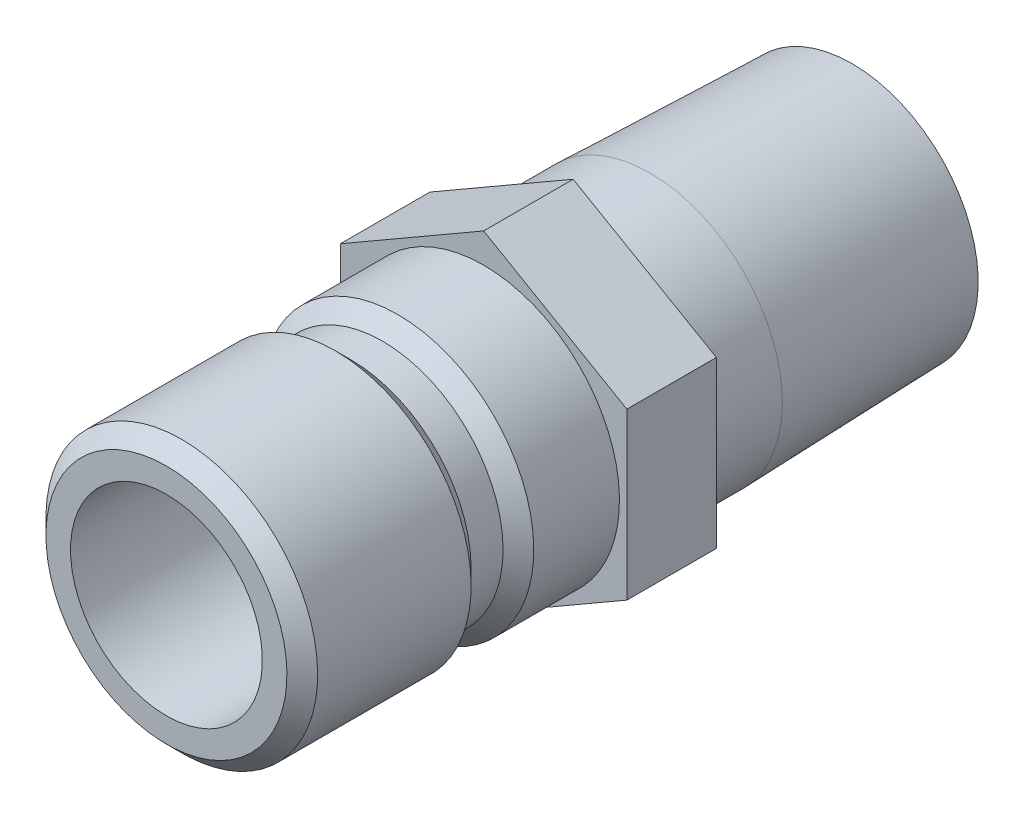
ISO-10303-21;
HEADER;
FILE_DESCRIPTION(('STEP AP214'),'2;1');
FILE_NAME('part.step','',(''),(''),'','','');
FILE_SCHEMA(('AUTOMOTIVE_DESIGN { 1 0 10303 214 1 1 1 1 }'));
ENDSEC;
DATA;
#1=APPLICATION_CONTEXT('core data for automotive mechanical design processes');
#2=APPLICATION_PROTOCOL_DEFINITION('international standard','automotive_design',2000,#1);
#3=PRODUCT_CONTEXT('',#1,'mechanical');
#4=PRODUCT('Part','Part','',(#3));
#5=PRODUCT_RELATED_PRODUCT_CATEGORY('part','',(#4));
#6=PRODUCT_DEFINITION_FORMATION('','',#4);
#7=PRODUCT_DEFINITION_CONTEXT('part definition',#1,'design');
#8=PRODUCT_DEFINITION('design','',#6,#7);
#9=PRODUCT_DEFINITION_SHAPE('','',#8);
#10=(LENGTH_UNIT() NAMED_UNIT(*) SI_UNIT(.MILLI.,.METRE.));
#11=(NAMED_UNIT(*) PLANE_ANGLE_UNIT() SI_UNIT($,.RADIAN.));
#12=(NAMED_UNIT(*) SI_UNIT($,.STERADIAN.) SOLID_ANGLE_UNIT());
#13=UNCERTAINTY_MEASURE_WITH_UNIT(LENGTH_MEASURE(1.E-05),#10,'distance_accuracy_value','');
#14=(GEOMETRIC_REPRESENTATION_CONTEXT(3) GLOBAL_UNCERTAINTY_ASSIGNED_CONTEXT((#13)) GLOBAL_UNIT_ASSIGNED_CONTEXT((#10,
#11,#12)) REPRESENTATION_CONTEXT('',''));
#15=CARTESIAN_POINT('',(0.,0.,0.));
#16=DIRECTION('',(0.,0.,1.));
#17=DIRECTION('',(1.,0.,0.));
#18=AXIS2_PLACEMENT_3D('',#15,#16,#17);
#19=CARTESIAN_POINT('',(0.,0.,0.));
#20=DIRECTION('',(0.,0.,-1.));
#21=DIRECTION('',(0.,1.,0.));
#22=AXIS2_PLACEMENT_3D('',#19,#20,#21);
#23=CYLINDRICAL_SURFACE('',#22,6.5786);
#24=CARTESIAN_POINT('',(0.,0.,-8.25500000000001));
#25=DIRECTION('',(0.,0.,-1.));
#26=DIRECTION('',(0.,1.,0.));
#27=AXIS2_PLACEMENT_3D('',#24,#25,#26);
#28=CIRCLE('',#27,6.5786);
#29=CARTESIAN_POINT('',(0.,6.5786,-8.25500000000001));
#30=VERTEX_POINT('',#29);
#31=EDGE_CURVE('E162',#30,#30,#28,.T.);
#32=ORIENTED_EDGE('',*,*,#31,.F.);
#33=EDGE_LOOP('',(#32));
#34=FACE_BOUND('',#33,.T.);
#35=CARTESIAN_POINT('',(0.,0.,-4.445));
#36=DIRECTION('',(0.,0.,1.));
#37=DIRECTION('',(1.,0.,0.));
#38=AXIS2_PLACEMENT_3D('',#35,#36,#37);
#39=CIRCLE('',#38,6.5786);
#40=CARTESIAN_POINT('',(6.5786,0.,-4.445));
#41=VERTEX_POINT('',#40);
#42=EDGE_CURVE('E142',#41,#41,#39,.F.);
#43=ORIENTED_EDGE('',*,*,#42,.T.);
#44=EDGE_LOOP('',(#43));
#45=FACE_BOUND('',#44,.T.);
#46=ADVANCED_FACE('F37',(#34,#45),#23,.T.);
#47=CARTESIAN_POINT('',(0.,0.,0.));
#48=DIRECTION('',(0.,0.,-1.));
#49=DIRECTION('',(0.,1.,0.));
#50=AXIS2_PLACEMENT_3D('',#47,#48,#49);
#51=CYLINDRICAL_SURFACE('',#50,4.7625);
#52=CARTESIAN_POINT('',(0.,0.,3.556));
#53=DIRECTION('',(0.,0.,-1.));
#54=DIRECTION('',(0.,1.,0.));
#55=AXIS2_PLACEMENT_3D('',#52,#53,#54);
#56=CIRCLE('',#55,4.7625);
#57=CARTESIAN_POINT('',(0.,4.7625,3.556));
#58=VERTEX_POINT('',#57);
#59=EDGE_CURVE('E150',#58,#58,#56,.T.);
#60=ORIENTED_EDGE('',*,*,#59,.T.);
#61=EDGE_LOOP('',(#60));
#62=FACE_BOUND('',#61,.T.);
#63=CARTESIAN_POINT('',(0.,0.,15.748));
#64=DIRECTION('',(0.,0.,-1.));
#65=DIRECTION('',(0.,1.,0.));
#66=AXIS2_PLACEMENT_3D('',#63,#64,#65);
#67=CIRCLE('',#66,4.7625);
#68=CARTESIAN_POINT('',(0.,4.7625,15.748));
#69=VERTEX_POINT('',#68);
#70=EDGE_CURVE('E11',#69,#69,#67,.T.);
#71=ORIENTED_EDGE('',*,*,#70,.F.);
#72=EDGE_LOOP('',(#71));
#73=FACE_BOUND('',#72,.T.);
#74=ADVANCED_FACE('F39',(#62,#73),#51,.F.);
#75=CARTESIAN_POINT('',(0.,4.7625,15.748));
#76=DIRECTION('',(0.,0.,1.));
#77=DIRECTION('',(0.,-1.,0.));
#78=AXIS2_PLACEMENT_3D('',#75,#76,#77);
#79=PLANE('',#78);
#80=ORIENTED_EDGE('',*,*,#70,.T.);
#81=EDGE_LOOP('',(#80));
#82=FACE_BOUND('',#81,.T.);
#83=CARTESIAN_POINT('',(0.,0.,15.748));
#84=DIRECTION('',(0.,0.,-1.));
#85=DIRECTION('',(0.,1.,0.));
#86=AXIS2_PLACEMENT_3D('',#83,#84,#85);
#87=CIRCLE('',#86,5.9817);
#88=CARTESIAN_POINT('',(0.,5.9817,15.748));
#89=VERTEX_POINT('',#88);
#90=EDGE_CURVE('E46',#89,#89,#87,.T.);
#91=ORIENTED_EDGE('',*,*,#90,.F.);
#92=EDGE_LOOP('',(#91));
#93=FACE_BOUND('',#92,.T.);
#94=ADVANCED_FACE('F188',(#82,#93),#79,.T.);
#95=CARTESIAN_POINT('',(0.,0.,14.986));
#96=DIRECTION('',(0.,0.,-1.));
#97=DIRECTION('',(0.,1.,0.));
#98=AXIS2_PLACEMENT_3D('',#95,#96,#97);
#99=CONICAL_SURFACE('',#98,6.7437,0.785398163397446);
#100=ORIENTED_EDGE('',*,*,#90,.T.);
#101=EDGE_LOOP('',(#100));
#102=FACE_BOUND('',#101,.T.);
#103=CARTESIAN_POINT('',(0.,0.,14.986));
#104=DIRECTION('',(0.,0.,-1.));
#105=DIRECTION('',(0.,1.,0.));
#106=AXIS2_PLACEMENT_3D('',#103,#104,#105);
#107=CIRCLE('',#106,6.7437);
#108=CARTESIAN_POINT('',(0.,6.7437,14.986));
#109=VERTEX_POINT('',#108);
#110=EDGE_CURVE('E180',#109,#109,#107,.T.);
#111=ORIENTED_EDGE('',*,*,#110,.F.);
#112=EDGE_LOOP('',(#111));
#113=FACE_BOUND('',#112,.T.);
#114=ADVANCED_FACE('F185',(#102,#113),#99,.T.);
#115=CARTESIAN_POINT('',(0.,0.,0.));
#116=DIRECTION('',(0.,0.,-1.));
#117=DIRECTION('',(0.,1.,0.));
#118=AXIS2_PLACEMENT_3D('',#115,#116,#117);
#119=CYLINDRICAL_SURFACE('',#118,6.7437);
#120=ORIENTED_EDGE('',*,*,#110,.T.);
#121=EDGE_LOOP('',(#120));
#122=FACE_BOUND('',#121,.T.);
#123=CARTESIAN_POINT('',(0.,0.,7.36599999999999));
#124=DIRECTION('',(0.,0.,-1.));
#125=DIRECTION('',(0.,1.,0.));
#126=AXIS2_PLACEMENT_3D('',#123,#124,#125);
#127=CIRCLE('',#126,6.7437);
#128=CARTESIAN_POINT('',(0.,6.7437,7.36599999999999));
#129=VERTEX_POINT('',#128);
#130=EDGE_CURVE('E177',#129,#129,#127,.T.);
#131=ORIENTED_EDGE('',*,*,#130,.F.);
#132=EDGE_LOOP('',(#131));
#133=FACE_BOUND('',#132,.T.);
#134=ADVANCED_FACE('F195',(#122,#133),#119,.T.);
#135=CARTESIAN_POINT('',(0.,0.,6.604));
#136=DIRECTION('',(0.,0.,1.));
#137=DIRECTION('',(0.,-1.,0.));
#138=AXIS2_PLACEMENT_3D('',#135,#136,#137);
#139=CONICAL_SURFACE('',#138,5.9817,0.785398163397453);
#140=ORIENTED_EDGE('',*,*,#130,.T.);
#141=EDGE_LOOP('',(#140));
#142=FACE_BOUND('',#141,.T.);
#143=CARTESIAN_POINT('',(0.,0.,6.604));
#144=DIRECTION('',(0.,0.,-1.));
#145=DIRECTION('',(0.,1.,0.));
#146=AXIS2_PLACEMENT_3D('',#143,#144,#145);
#147=CIRCLE('',#146,5.9817);
#148=CARTESIAN_POINT('',(0.,5.9817,6.604));
#149=VERTEX_POINT('',#148);
#150=EDGE_CURVE('E174',#149,#149,#147,.T.);
#151=ORIENTED_EDGE('',*,*,#150,.F.);
#152=EDGE_LOOP('',(#151));
#153=FACE_BOUND('',#152,.T.);
#154=ADVANCED_FACE('F220',(#142,#153),#139,.T.);
#155=CARTESIAN_POINT('',(0.,0.,0.));
#156=DIRECTION('',(0.,0.,-1.));
#157=DIRECTION('',(0.,1.,0.));
#158=AXIS2_PLACEMENT_3D('',#155,#156,#157);
#159=CYLINDRICAL_SURFACE('',#158,5.9817);
#160=ORIENTED_EDGE('',*,*,#150,.T.);
#161=EDGE_LOOP('',(#160));
#162=FACE_BOUND('',#161,.T.);
#163=CARTESIAN_POINT('',(0.,0.,5.0165));
#164=DIRECTION('',(0.,0.,-1.));
#165=DIRECTION('',(0.,1.,0.));
#166=AXIS2_PLACEMENT_3D('',#163,#164,#165);
#167=CIRCLE('',#166,5.9817);
#168=CARTESIAN_POINT('',(0.,5.9817,5.0165));
#169=VERTEX_POINT('',#168);
#170=EDGE_CURVE('E171',#169,#169,#167,.T.);
#171=ORIENTED_EDGE('',*,*,#170,.F.);
#172=EDGE_LOOP('',(#171));
#173=FACE_BOUND('',#172,.T.);
#174=ADVANCED_FACE('F216',(#162,#173),#159,.T.);
#175=CARTESIAN_POINT('',(0.,0.,4.25449999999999));
#176=DIRECTION('',(0.,0.,-1.));
#177=DIRECTION('',(0.,1.,0.));
#178=AXIS2_PLACEMENT_3D('',#175,#176,#177);
#179=CONICAL_SURFACE('',#178,6.7437,0.785398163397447);
#180=ORIENTED_EDGE('',*,*,#170,.T.);
#181=EDGE_LOOP('',(#180));
#182=FACE_BOUND('',#181,.T.);
#183=CARTESIAN_POINT('',(0.,0.,4.25449999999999));
#184=DIRECTION('',(0.,0.,-1.));
#185=DIRECTION('',(0.,1.,0.));
#186=AXIS2_PLACEMENT_3D('',#183,#184,#185);
#187=CIRCLE('',#186,6.7437);
#188=CARTESIAN_POINT('',(0.,6.7437,4.25449999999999));
#189=VERTEX_POINT('',#188);
#190=EDGE_CURVE('E168',#189,#189,#187,.T.);
#191=ORIENTED_EDGE('',*,*,#190,.F.);
#192=EDGE_LOOP('',(#191));
#193=FACE_BOUND('',#192,.T.);
#194=ADVANCED_FACE('F212',(#182,#193),#179,.T.);
#195=CARTESIAN_POINT('',(0.,0.,0.));
#196=DIRECTION('',(0.,0.,-1.));
#197=DIRECTION('',(0.,1.,0.));
#198=AXIS2_PLACEMENT_3D('',#195,#196,#197);
#199=CYLINDRICAL_SURFACE('',#198,6.7437);
#200=ORIENTED_EDGE('',*,*,#190,.T.);
#201=EDGE_LOOP('',(#200));
#202=FACE_BOUND('',#201,.T.);
#203=CARTESIAN_POINT('',(0.,0.,0.));
#204=DIRECTION('',(0.,0.,-1.));
#205=DIRECTION('',(0.,1.,0.));
#206=AXIS2_PLACEMENT_3D('',#203,#204,#205);
#207=CIRCLE('',#206,6.7437);
#208=CARTESIAN_POINT('',(0.,6.7437,0.));
#209=VERTEX_POINT('',#208);
#210=EDGE_CURVE('E165',#209,#209,#207,.T.);
#211=ORIENTED_EDGE('',*,*,#210,.F.);
#212=EDGE_LOOP('',(#211));
#213=FACE_BOUND('',#212,.T.);
#214=ADVANCED_FACE('F209',(#202,#213),#199,.T.);
#215=CARTESIAN_POINT('',(0.,0.,-18.288));
#216=DIRECTION('',(0.,0.,1.));
#217=DIRECTION('',(0.,-1.,0.));
#218=AXIS2_PLACEMENT_3D('',#215,#216,#217);
#219=CONICAL_SURFACE('',#218,6.26507060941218,0.0312396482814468);
#220=ORIENTED_EDGE('',*,*,#31,.T.);
#221=EDGE_LOOP('',(#220));
#222=FACE_BOUND('',#221,.T.);
#223=CARTESIAN_POINT('',(0.,0.,-18.288));
#224=DIRECTION('',(0.,0.,-1.));
#225=DIRECTION('',(0.,1.,0.));
#226=AXIS2_PLACEMENT_3D('',#223,#224,#225);
#227=CIRCLE('',#226,6.26507060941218);
#228=CARTESIAN_POINT('',(0.,6.26507060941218,-18.288));
#229=VERTEX_POINT('',#228);
#230=EDGE_CURVE('E159',#229,#229,#227,.T.);
#231=ORIENTED_EDGE('',*,*,#230,.F.);
#232=EDGE_LOOP('',(#231));
#233=FACE_BOUND('',#232,.T.);
#234=ADVANCED_FACE('F207',(#222,#233),#219,.T.);
#235=CARTESIAN_POINT('',(0.,6.26507060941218,-18.288));
#236=DIRECTION('',(0.,0.,-1.));
#237=DIRECTION('',(0.,1.,0.));
#238=AXIS2_PLACEMENT_3D('',#235,#236,#237);
#239=PLANE('',#238);
#240=ORIENTED_EDGE('',*,*,#230,.T.);
#241=EDGE_LOOP('',(#240));
#242=FACE_BOUND('',#241,.T.);
#243=CARTESIAN_POINT('',(0.,0.,-18.288));
#244=DIRECTION('',(0.,0.,-1.));
#245=DIRECTION('',(0.,1.,0.));
#246=AXIS2_PLACEMENT_3D('',#243,#244,#245);
#247=CIRCLE('',#246,4.6228);
#248=CARTESIAN_POINT('',(0.,4.6228,-18.288));
#249=VERTEX_POINT('',#248);
#250=EDGE_CURVE('E156',#249,#249,#247,.T.);
#251=ORIENTED_EDGE('',*,*,#250,.F.);
#252=EDGE_LOOP('',(#251));
#253=FACE_BOUND('',#252,.T.);
#254=ADVANCED_FACE('F273',(#242,#253),#239,.T.);
#255=CARTESIAN_POINT('',(0.,0.,0.));
#256=DIRECTION('',(0.,0.,-1.));
#257=DIRECTION('',(0.,1.,0.));
#258=AXIS2_PLACEMENT_3D('',#255,#256,#257);
#259=CYLINDRICAL_SURFACE('',#258,4.6228);
#260=CARTESIAN_POINT('',(0.,0.,3.48172019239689));
#261=DIRECTION('',(0.,0.,-1.));
#262=DIRECTION('',(0.,1.,0.));
#263=AXIS2_PLACEMENT_3D('',#260,#261,#262);
#264=CIRCLE('',#263,4.6228);
#265=CARTESIAN_POINT('',(0.,4.6228,3.48172019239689));
#266=VERTEX_POINT('',#265);
#267=EDGE_CURVE('E153',#266,#266,#264,.T.);
#268=ORIENTED_EDGE('',*,*,#267,.F.);
#269=EDGE_LOOP('',(#268));
#270=FACE_BOUND('',#269,.T.);
#271=ORIENTED_EDGE('',*,*,#250,.T.);
#272=EDGE_LOOP('',(#271));
#273=FACE_BOUND('',#272,.T.);
#274=ADVANCED_FACE('F270',(#270,#273),#259,.F.);
#275=CARTESIAN_POINT('',(0.,0.,3.556));
#276=DIRECTION('',(0.,0.,1.));
#277=DIRECTION('',(0.,-1.,0.));
#278=AXIS2_PLACEMENT_3D('',#275,#276,#277);
#279=CONICAL_SURFACE('',#278,4.7625,1.08210413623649);
#280=ORIENTED_EDGE('',*,*,#267,.T.);
#281=EDGE_LOOP('',(#280));
#282=FACE_BOUND('',#281,.T.);
#283=ORIENTED_EDGE('',*,*,#59,.F.);
#284=EDGE_LOOP('',(#283));
#285=FACE_BOUND('',#284,.T.);
#286=ADVANCED_FACE('F258',(#282,#285),#279,.F.);
#287=CARTESIAN_POINT('',(0.,8.21223022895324,-4.445));
#288=DIRECTION('',(-0.5,0.866025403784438,0.));
#289=DIRECTION('',(-0.866025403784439,-0.5,0.));
#290=AXIS2_PLACEMENT_3D('',#287,#288,#289);
#291=PLANE('',#290);
#292=DIRECTION('',(-0.866025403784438,-0.5,0.));
#293=VECTOR('',#292,1.);
#294=CARTESIAN_POINT('',(0.,8.21223022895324,0.));
#295=LINE('',#294,#293);
#296=CARTESIAN_POINT('',(0.,8.21223022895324,0.));
#297=VERTEX_POINT('',#296);
#298=CARTESIAN_POINT('',(-7.112,4.10611511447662,0.));
#299=VERTEX_POINT('',#298);
#300=EDGE_CURVE('E125',#297,#299,#295,.T.);
#301=ORIENTED_EDGE('',*,*,#300,.F.);
#302=DIRECTION('',(0.,0.,1.));
#303=VECTOR('',#302,1.);
#304=CARTESIAN_POINT('',(0.,8.21223022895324,-4.445));
#305=LINE('',#304,#303);
#306=CARTESIAN_POINT('',(0.,8.21223022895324,-4.445));
#307=VERTEX_POINT('',#306);
#308=EDGE_CURVE('E54',#307,#297,#305,.T.);
#309=ORIENTED_EDGE('',*,*,#308,.F.);
#310=DIRECTION('',(-0.866025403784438,-0.5,0.));
#311=VECTOR('',#310,1.);
#312=CARTESIAN_POINT('',(0.,8.21223022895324,-4.445));
#313=LINE('',#312,#311);
#314=CARTESIAN_POINT('',(-7.112,4.10611511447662,-4.445));
#315=VERTEX_POINT('',#314);
#316=EDGE_CURVE('E140',#307,#315,#313,.T.);
#317=ORIENTED_EDGE('',*,*,#316,.T.);
#318=DIRECTION('',(0.,0.,1.));
#319=VECTOR('',#318,1.);
#320=CARTESIAN_POINT('',(-7.112,4.10611511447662,-4.445));
#321=LINE('',#320,#319);
#322=EDGE_CURVE('E89',#315,#299,#321,.T.);
#323=ORIENTED_EDGE('',*,*,#322,.T.);
#324=EDGE_LOOP('',(#301,#309,#317,#323));
#325=FACE_BOUND('',#324,.T.);
#326=ADVANCED_FACE('F245',(#325),#291,.T.);
#327=CARTESIAN_POINT('',(7.112,4.10611511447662,-4.445));
#328=DIRECTION('',(0.5,0.866025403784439,0.));
#329=DIRECTION('',(-0.866025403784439,0.5,0.));
#330=AXIS2_PLACEMENT_3D('',#327,#328,#329);
#331=PLANE('',#330);
#332=DIRECTION('',(-0.866025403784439,0.5,0.));
#333=VECTOR('',#332,1.);
#334=CARTESIAN_POINT('',(7.112,4.10611511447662,0.));
#335=LINE('',#334,#333);
#336=CARTESIAN_POINT('',(7.112,4.10611511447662,0.));
#337=VERTEX_POINT('',#336);
#338=EDGE_CURVE('E137',#337,#297,#335,.T.);
#339=ORIENTED_EDGE('',*,*,#338,.F.);
#340=DIRECTION('',(0.,0.,1.));
#341=VECTOR('',#340,1.);
#342=CARTESIAN_POINT('',(7.112,4.10611511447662,-4.445));
#343=LINE('',#342,#341);
#344=CARTESIAN_POINT('',(7.112,4.10611511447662,-4.445));
#345=VERTEX_POINT('',#344);
#346=EDGE_CURVE('E77',#345,#337,#343,.T.);
#347=ORIENTED_EDGE('',*,*,#346,.F.);
#348=DIRECTION('',(-0.866025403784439,0.5,0.));
#349=VECTOR('',#348,1.);
#350=CARTESIAN_POINT('',(7.112,4.10611511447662,-4.445));
#351=LINE('',#350,#349);
#352=EDGE_CURVE('E115',#345,#307,#351,.T.);
#353=ORIENTED_EDGE('',*,*,#352,.T.);
#354=ORIENTED_EDGE('',*,*,#308,.T.);
#355=EDGE_LOOP('',(#339,#347,#353,#354));
#356=FACE_BOUND('',#355,.T.);
#357=ADVANCED_FACE('F250',(#356),#331,.T.);
#358=CARTESIAN_POINT('',(7.112,-4.10611511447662,-4.445));
#359=DIRECTION('',(1.,0.,0.));
#360=DIRECTION('',(0.,1.,0.));
#361=AXIS2_PLACEMENT_3D('',#358,#359,#360);
#362=PLANE('',#361);
#363=DIRECTION('',(0.,1.,0.));
#364=VECTOR('',#363,1.);
#365=CARTESIAN_POINT('',(7.112,-4.10611511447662,0.));
#366=LINE('',#365,#364);
#367=CARTESIAN_POINT('',(7.112,-4.10611511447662,0.));
#368=VERTEX_POINT('',#367);
#369=EDGE_CURVE('E102',#368,#337,#366,.T.);
#370=ORIENTED_EDGE('',*,*,#369,.F.);
#371=DIRECTION('',(0.,0.,1.));
#372=VECTOR('',#371,1.);
#373=CARTESIAN_POINT('',(7.112,-4.10611511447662,-4.445));
#374=LINE('',#373,#372);
#375=CARTESIAN_POINT('',(7.112,-4.10611511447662,-4.445));
#376=VERTEX_POINT('',#375);
#377=EDGE_CURVE('E97',#376,#368,#374,.T.);
#378=ORIENTED_EDGE('',*,*,#377,.F.);
#379=DIRECTION('',(0.,1.,0.));
#380=VECTOR('',#379,1.);
#381=CARTESIAN_POINT('',(7.112,-4.10611511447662,-4.445));
#382=LINE('',#381,#380);
#383=EDGE_CURVE('E100',#376,#345,#382,.T.);
#384=ORIENTED_EDGE('',*,*,#383,.T.);
#385=ORIENTED_EDGE('',*,*,#346,.T.);
#386=EDGE_LOOP('',(#370,#378,#384,#385));
#387=FACE_BOUND('',#386,.T.);
#388=ADVANCED_FACE('F99',(#387),#362,.T.);
#389=CARTESIAN_POINT('',(0.,-8.21223022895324,-4.445));
#390=DIRECTION('',(0.5,-0.866025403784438,0.));
#391=DIRECTION('',(0.866025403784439,0.5,0.));
#392=AXIS2_PLACEMENT_3D('',#389,#390,#391);
#393=PLANE('',#392);
#394=DIRECTION('',(0.866025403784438,0.5,0.));
#395=VECTOR('',#394,1.);
#396=CARTESIAN_POINT('',(0.,-8.21223022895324,0.));
#397=LINE('',#396,#395);
#398=CARTESIAN_POINT('',(0.,-8.21223022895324,0.));
#399=VERTEX_POINT('',#398);
#400=EDGE_CURVE('E134',#399,#368,#397,.T.);
#401=ORIENTED_EDGE('',*,*,#400,.F.);
#402=DIRECTION('',(0.,0.,1.));
#403=VECTOR('',#402,1.);
#404=CARTESIAN_POINT('',(0.,-8.21223022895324,-4.445));
#405=LINE('',#404,#403);
#406=CARTESIAN_POINT('',(0.,-8.21223022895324,-4.445));
#407=VERTEX_POINT('',#406);
#408=EDGE_CURVE('E107',#407,#399,#405,.T.);
#409=ORIENTED_EDGE('',*,*,#408,.F.);
#410=DIRECTION('',(0.866025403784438,0.5,0.));
#411=VECTOR('',#410,1.);
#412=CARTESIAN_POINT('',(0.,-8.21223022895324,-4.445));
#413=LINE('',#412,#411);
#414=EDGE_CURVE('E113',#407,#376,#413,.T.);
#415=ORIENTED_EDGE('',*,*,#414,.T.);
#416=ORIENTED_EDGE('',*,*,#377,.T.);
#417=EDGE_LOOP('',(#401,#409,#415,#416));
#418=FACE_BOUND('',#417,.T.);
#419=ADVANCED_FACE('F117',(#418),#393,.T.);
#420=CARTESIAN_POINT('',(-7.112,-4.10611511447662,-4.445));
#421=DIRECTION('',(-0.5,-0.866025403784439,0.));
#422=DIRECTION('',(0.866025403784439,-0.5,0.));
#423=AXIS2_PLACEMENT_3D('',#420,#421,#422);
#424=PLANE('',#423);
#425=DIRECTION('',(0.866025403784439,-0.5,0.));
#426=VECTOR('',#425,1.);
#427=CARTESIAN_POINT('',(-7.112,-4.10611511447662,0.));
#428=LINE('',#427,#426);
#429=CARTESIAN_POINT('',(-7.112,-4.10611511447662,0.));
#430=VERTEX_POINT('',#429);
#431=EDGE_CURVE('E131',#430,#399,#428,.T.);
#432=ORIENTED_EDGE('',*,*,#431,.F.);
#433=DIRECTION('',(0.,0.,1.));
#434=VECTOR('',#433,1.);
#435=CARTESIAN_POINT('',(-7.112,-4.10611511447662,-4.445));
#436=LINE('',#435,#434);
#437=CARTESIAN_POINT('',(-7.112,-4.10611511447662,-4.445));
#438=VERTEX_POINT('',#437);
#439=EDGE_CURVE('E145',#438,#430,#436,.T.);
#440=ORIENTED_EDGE('',*,*,#439,.F.);
#441=DIRECTION('',(0.866025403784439,-0.5,0.));
#442=VECTOR('',#441,1.);
#443=CARTESIAN_POINT('',(-7.112,-4.10611511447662,-4.445));
#444=LINE('',#443,#442);
#445=EDGE_CURVE('E118',#438,#407,#444,.T.);
#446=ORIENTED_EDGE('',*,*,#445,.T.);
#447=ORIENTED_EDGE('',*,*,#408,.T.);
#448=EDGE_LOOP('',(#432,#440,#446,#447));
#449=FACE_BOUND('',#448,.T.);
#450=ADVANCED_FACE('F249',(#449),#424,.T.);
#451=CARTESIAN_POINT('',(-7.112,4.10611511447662,-4.445));
#452=DIRECTION('',(-1.,0.,0.));
#453=DIRECTION('',(0.,0.,1.));
#454=AXIS2_PLACEMENT_3D('',#451,#452,#453);
#455=PLANE('',#454);
#456=DIRECTION('',(0.,-1.,0.));
#457=VECTOR('',#456,1.);
#458=CARTESIAN_POINT('',(-7.112,4.10611511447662,0.));
#459=LINE('',#458,#457);
#460=EDGE_CURVE('E128',#299,#430,#459,.T.);
#461=ORIENTED_EDGE('',*,*,#460,.F.);
#462=ORIENTED_EDGE('',*,*,#322,.F.);
#463=DIRECTION('',(0.,-1.,0.));
#464=VECTOR('',#463,1.);
#465=CARTESIAN_POINT('',(-7.112,4.10611511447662,-4.445));
#466=LINE('',#465,#464);
#467=EDGE_CURVE('E120',#315,#438,#466,.T.);
#468=ORIENTED_EDGE('',*,*,#467,.T.);
#469=ORIENTED_EDGE('',*,*,#439,.T.);
#470=EDGE_LOOP('',(#461,#462,#468,#469));
#471=FACE_BOUND('',#470,.T.);
#472=ADVANCED_FACE('F246',(#471),#455,.T.);
#473=CARTESIAN_POINT('',(-7.112,4.10611511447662,-4.445));
#474=DIRECTION('',(0.,0.,1.));
#475=DIRECTION('',(1.,0.,0.));
#476=AXIS2_PLACEMENT_3D('',#473,#474,#475);
#477=PLANE('',#476);
#478=ORIENTED_EDGE('',*,*,#42,.F.);
#479=EDGE_LOOP('',(#478));
#480=FACE_BOUND('',#479,.T.);
#481=ORIENTED_EDGE('',*,*,#316,.F.);
#482=ORIENTED_EDGE('',*,*,#352,.F.);
#483=ORIENTED_EDGE('',*,*,#383,.F.);
#484=ORIENTED_EDGE('',*,*,#414,.F.);
#485=ORIENTED_EDGE('',*,*,#445,.F.);
#486=ORIENTED_EDGE('',*,*,#467,.F.);
#487=EDGE_LOOP('',(#481,#482,#483,#484,#485,#486));
#488=FACE_BOUND('',#487,.T.);
#489=ADVANCED_FACE('F111',(#480,#488),#477,.F.);
#490=CARTESIAN_POINT('',(-7.112,4.10611511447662,0.));
#491=DIRECTION('',(0.,0.,1.));
#492=DIRECTION('',(1.,0.,0.));
#493=AXIS2_PLACEMENT_3D('',#490,#491,#492);
#494=PLANE('',#493);
#495=ORIENTED_EDGE('',*,*,#210,.T.);
#496=EDGE_LOOP('',(#495));
#497=FACE_BOUND('',#496,.T.);
#498=ORIENTED_EDGE('',*,*,#300,.T.);
#499=ORIENTED_EDGE('',*,*,#460,.T.);
#500=ORIENTED_EDGE('',*,*,#431,.T.);
#501=ORIENTED_EDGE('',*,*,#400,.T.);
#502=ORIENTED_EDGE('',*,*,#369,.T.);
#503=ORIENTED_EDGE('',*,*,#338,.T.);
#504=EDGE_LOOP('',(#498,#499,#500,#501,#502,#503));
#505=FACE_BOUND('',#504,.T.);
#506=ADVANCED_FACE('F241',(#497,#505),#494,.T.);
#507=CLOSED_SHELL('',(#46,#74,#94,#114,#134,#154,#174,#194,#214,#234,#254,#274,#286,#326,#357,
#388,#419,#450,#472,#489,#506));
#508=MANIFOLD_SOLID_BREP('B2',#507);
#509=ADVANCED_BREP_SHAPE_REPRESENTATION('',(#18,#508),#14);
#510=SHAPE_DEFINITION_REPRESENTATION(#9,#509);
ENDSEC;
END-ISO-10303-21;
